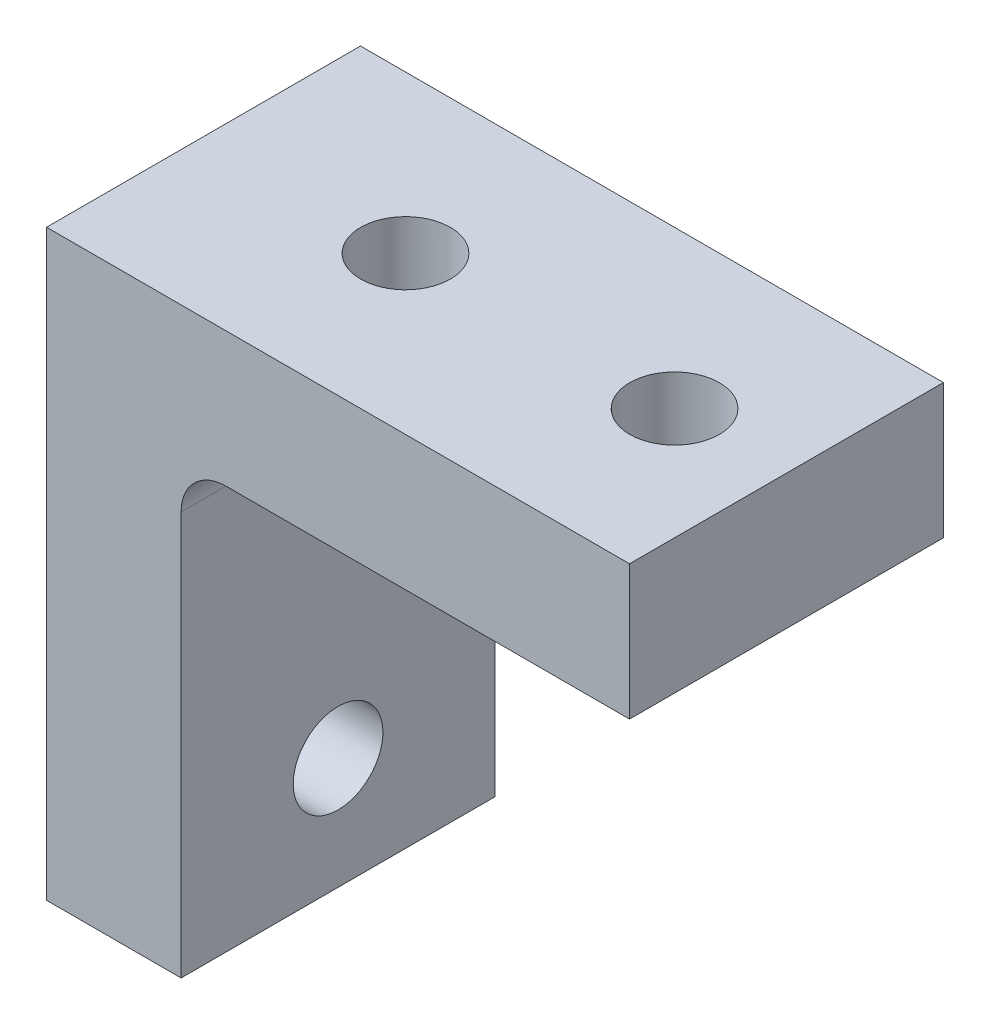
from build123d import *

# Parameters (mm, degrees)
BOSS_EXTRUDE1_DEPTH             = 11.1125
FILLET1_R                       = 3.175
F_1_4_0_25_DIAMETER_HOLE1_D     = 6.35
F_1_4_0_25_DIAMETER_HOLE1_DEPTH = 20.32
F_1_4_0_25_DIAMETER_HOLE1_TIP   = 1.907732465
F_1_4_0_25_DIAMETER_HOLE2_D     = 6.35
F_1_4_0_25_DIAMETER_HOLE2_DEPTH = 20.32
F_1_4_0_25_DIAMETER_HOLE2_TIP   = 1.907732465


with BuildPart() as part:
    # Sketch2 → Boss-Extrude1 (new, symmetric)
    with BuildSketch(Plane.XY):
        Polygon((0, -41.275), (9.525, -41.275), (9.525, -9.525), (41.275, -9.525), (41.275, 0), (0, 0), align=None)
    extrude(amount=BOSS_EXTRUDE1_DEPTH, both=True)

    # Fillet1
    fillet1_edges = [part.edges().sort_by_distance(p)[0] for p in [
        (9.525, -9.525, 0),
    ]]
    fillet(fillet1_edges, radius=FILLET1_R)

    # 1_4 _0.25_ Diameter Hole1
    with Locations(Plane.ZY):
        with Locations((0, -33.3502), (0, -14.3002)):
            Hole(F_1_4_0_25_DIAMETER_HOLE1_D / 2, depth=F_1_4_0_25_DIAMETER_HOLE1_DEPTH)
            with Locations((0, 0, -(F_1_4_0_25_DIAMETER_HOLE1_DEPTH + F_1_4_0_25_DIAMETER_HOLE1_TIP / 2))):  # 118° drill point
                Cone(0, F_1_4_0_25_DIAMETER_HOLE1_D / 2, F_1_4_0_25_DIAMETER_HOLE1_TIP, mode=Mode.SUBTRACT)

    # 1_4 _0.25_ Diameter Hole2
    with Locations(Plane(origin=(0, 0, 0), x_dir=(1, 0, 0), z_dir=(0, 1, 0))):
        with Locations((14.3002, 0), (33.3502, 0)):
            Hole(F_1_4_0_25_DIAMETER_HOLE2_D / 2, depth=F_1_4_0_25_DIAMETER_HOLE2_DEPTH)
            with Locations((0, 0, -(F_1_4_0_25_DIAMETER_HOLE2_DEPTH + F_1_4_0_25_DIAMETER_HOLE2_TIP / 2))):  # 118° drill point
                Cone(0, F_1_4_0_25_DIAMETER_HOLE2_D / 2, F_1_4_0_25_DIAMETER_HOLE2_TIP, mode=Mode.SUBTRACT)


solid = part.part
